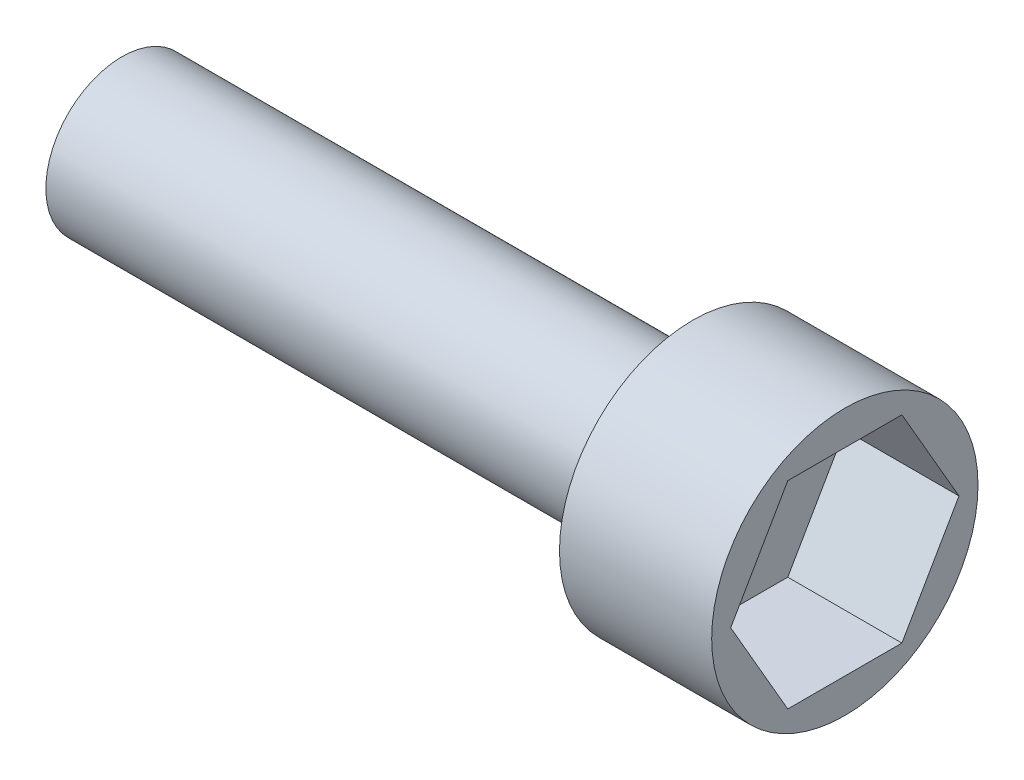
ISO-10303-21;
HEADER;
FILE_DESCRIPTION(('STEP AP214'),'2;1');
FILE_NAME('part.step','',(''),(''),'','','');
FILE_SCHEMA(('AUTOMOTIVE_DESIGN { 1 0 10303 214 1 1 1 1 }'));
ENDSEC;
DATA;
#1=APPLICATION_CONTEXT('core data for automotive mechanical design processes');
#2=APPLICATION_PROTOCOL_DEFINITION('international standard','automotive_design',2000,#1);
#3=PRODUCT_CONTEXT('',#1,'mechanical');
#4=PRODUCT('Part','Part','',(#3));
#5=PRODUCT_RELATED_PRODUCT_CATEGORY('part','',(#4));
#6=PRODUCT_DEFINITION_FORMATION('','',#4);
#7=PRODUCT_DEFINITION_CONTEXT('part definition',#1,'design');
#8=PRODUCT_DEFINITION('design','',#6,#7);
#9=PRODUCT_DEFINITION_SHAPE('','',#8);
#10=(LENGTH_UNIT() NAMED_UNIT(*) SI_UNIT(.MILLI.,.METRE.));
#11=(NAMED_UNIT(*) PLANE_ANGLE_UNIT() SI_UNIT($,.RADIAN.));
#12=(NAMED_UNIT(*) SI_UNIT($,.STERADIAN.) SOLID_ANGLE_UNIT());
#13=UNCERTAINTY_MEASURE_WITH_UNIT(LENGTH_MEASURE(1.E-05),#10,'distance_accuracy_value','');
#14=(GEOMETRIC_REPRESENTATION_CONTEXT(3) GLOBAL_UNCERTAINTY_ASSIGNED_CONTEXT((#13)) GLOBAL_UNIT_ASSIGNED_CONTEXT((#10,
#11,#12)) REPRESENTATION_CONTEXT('',''));
#15=CARTESIAN_POINT('',(0.,0.,0.));
#16=DIRECTION('',(0.,0.,1.));
#17=DIRECTION('',(1.,0.,0.));
#18=AXIS2_PLACEMENT_3D('',#15,#16,#17);
#19=CARTESIAN_POINT('',(15.,0.,0.));
#20=DIRECTION('',(-1.,0.,0.));
#21=DIRECTION('',(0.,0.,1.));
#22=AXIS2_PLACEMENT_3D('',#19,#20,#21);
#23=CYLINDRICAL_SURFACE('',#22,2.);
#24=CARTESIAN_POINT('',(15.,0.,0.));
#25=DIRECTION('',(1.,0.,0.));
#26=DIRECTION('',(0.,0.,-1.));
#27=AXIS2_PLACEMENT_3D('',#24,#25,#26);
#28=CIRCLE('',#27,2.);
#29=CARTESIAN_POINT('',(15.,0.,-2.));
#30=VERTEX_POINT('',#29);
#31=EDGE_CURVE('E11',#30,#30,#28,.T.);
#32=ORIENTED_EDGE('',*,*,#31,.F.);
#33=EDGE_LOOP('',(#32));
#34=FACE_BOUND('',#33,.T.);
#35=CARTESIAN_POINT('',(0.,0.,0.));
#36=DIRECTION('',(1.,0.,0.));
#37=DIRECTION('',(0.,0.,-1.));
#38=AXIS2_PLACEMENT_3D('',#35,#36,#37);
#39=CIRCLE('',#38,2.);
#40=CARTESIAN_POINT('',(0.,0.,-2.));
#41=VERTEX_POINT('',#40);
#42=EDGE_CURVE('E48',#41,#41,#39,.T.);
#43=ORIENTED_EDGE('',*,*,#42,.T.);
#44=EDGE_LOOP('',(#43));
#45=FACE_BOUND('',#44,.T.);
#46=ADVANCED_FACE('F45',(#34,#45),#23,.T.);
#47=CARTESIAN_POINT('',(0.,0.,0.));
#48=DIRECTION('',(1.,0.,0.));
#49=DIRECTION('',(0.,0.,-1.));
#50=AXIS2_PLACEMENT_3D('',#47,#48,#49);
#51=PLANE('',#50);
#52=ORIENTED_EDGE('',*,*,#42,.F.);
#53=EDGE_LOOP('',(#52));
#54=FACE_BOUND('',#53,.T.);
#55=ADVANCED_FACE('F196',(#54),#51,.F.);
#56=CARTESIAN_POINT('',(19.,0.,0.));
#57=DIRECTION('',(-1.,0.,0.));
#58=DIRECTION('',(0.,0.,1.));
#59=AXIS2_PLACEMENT_3D('',#56,#57,#58);
#60=CYLINDRICAL_SURFACE('',#59,3.5);
#61=CARTESIAN_POINT('',(19.,0.,0.));
#62=DIRECTION('',(1.,0.,0.));
#63=DIRECTION('',(0.,0.,-1.));
#64=AXIS2_PLACEMENT_3D('',#61,#62,#63);
#65=CIRCLE('',#64,3.5);
#66=CARTESIAN_POINT('',(19.,0.,-3.5));
#67=VERTEX_POINT('',#66);
#68=EDGE_CURVE('E169',#67,#67,#65,.T.);
#69=ORIENTED_EDGE('',*,*,#68,.F.);
#70=EDGE_LOOP('',(#69));
#71=FACE_BOUND('',#70,.T.);
#72=CARTESIAN_POINT('',(15.,0.,0.));
#73=DIRECTION('',(1.,0.,0.));
#74=DIRECTION('',(0.,0.,-1.));
#75=AXIS2_PLACEMENT_3D('',#72,#73,#74);
#76=CIRCLE('',#75,3.5);
#77=CARTESIAN_POINT('',(15.,0.,-3.5));
#78=VERTEX_POINT('',#77);
#79=EDGE_CURVE('E159',#78,#78,#76,.T.);
#80=ORIENTED_EDGE('',*,*,#79,.T.);
#81=EDGE_LOOP('',(#80));
#82=FACE_BOUND('',#81,.T.);
#83=ADVANCED_FACE('F177',(#71,#82),#60,.T.);
#84=CARTESIAN_POINT('',(19.,0.,0.));
#85=DIRECTION('',(1.,0.,0.));
#86=DIRECTION('',(0.,0.,-1.));
#87=AXIS2_PLACEMENT_3D('',#84,#85,#86);
#88=PLANE('',#87);
#89=DIRECTION('',(0.,-0.866025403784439,0.5));
#90=VECTOR('',#89,1.);
#91=CARTESIAN_POINT('',(19.,2.59807621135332,1.5));
#92=LINE('',#91,#90);
#93=CARTESIAN_POINT('',(19.,2.59807621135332,1.5));
#94=VERTEX_POINT('',#93);
#95=CARTESIAN_POINT('',(19.,0.,3.));
#96=VERTEX_POINT('',#95);
#97=EDGE_CURVE('E60',#94,#96,#92,.T.);
#98=ORIENTED_EDGE('',*,*,#97,.F.);
#99=DIRECTION('',(0.,0.,1.));
#100=VECTOR('',#99,1.);
#101=CARTESIAN_POINT('',(19.,2.59807621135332,-1.5));
#102=LINE('',#101,#100);
#103=CARTESIAN_POINT('',(19.,2.59807621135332,-1.5));
#104=VERTEX_POINT('',#103);
#105=EDGE_CURVE('E153',#104,#94,#102,.T.);
#106=ORIENTED_EDGE('',*,*,#105,.F.);
#107=DIRECTION('',(0.,0.866025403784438,0.5));
#108=VECTOR('',#107,1.);
#109=CARTESIAN_POINT('',(19.,0.,-3.));
#110=LINE('',#109,#108);
#111=CARTESIAN_POINT('',(19.,0.,-3.));
#112=VERTEX_POINT('',#111);
#113=EDGE_CURVE('E150',#112,#104,#110,.T.);
#114=ORIENTED_EDGE('',*,*,#113,.F.);
#115=DIRECTION('',(0.,0.866025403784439,-0.5));
#116=VECTOR('',#115,1.);
#117=CARTESIAN_POINT('',(19.,-2.59807621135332,-1.5));
#118=LINE('',#117,#116);
#119=CARTESIAN_POINT('',(19.,-2.59807621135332,-1.5));
#120=VERTEX_POINT('',#119);
#121=EDGE_CURVE('E108',#120,#112,#118,.T.);
#122=ORIENTED_EDGE('',*,*,#121,.F.);
#123=DIRECTION('',(0.,0.,-1.));
#124=VECTOR('',#123,1.);
#125=CARTESIAN_POINT('',(19.,-2.59807621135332,1.5));
#126=LINE('',#125,#124);
#127=CARTESIAN_POINT('',(19.,-2.59807621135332,1.5));
#128=VERTEX_POINT('',#127);
#129=EDGE_CURVE('E144',#128,#120,#126,.T.);
#130=ORIENTED_EDGE('',*,*,#129,.F.);
#131=DIRECTION('',(0.,-0.866025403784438,-0.5));
#132=VECTOR('',#131,1.);
#133=CARTESIAN_POINT('',(19.,0.,3.));
#134=LINE('',#133,#132);
#135=EDGE_CURVE('E140',#96,#128,#134,.T.);
#136=ORIENTED_EDGE('',*,*,#135,.F.);
#137=EDGE_LOOP('',(#98,#106,#114,#122,#130,#136));
#138=FACE_BOUND('',#137,.T.);
#139=ORIENTED_EDGE('',*,*,#68,.T.);
#140=EDGE_LOOP('',(#139));
#141=FACE_BOUND('',#140,.T.);
#142=ADVANCED_FACE('F182',(#138,#141),#88,.T.);
#143=CARTESIAN_POINT('',(15.,0.,0.));
#144=DIRECTION('',(1.,0.,0.));
#145=DIRECTION('',(0.,0.,-1.));
#146=AXIS2_PLACEMENT_3D('',#143,#144,#145);
#147=PLANE('',#146);
#148=ORIENTED_EDGE('',*,*,#31,.T.);
#149=EDGE_LOOP('',(#148));
#150=FACE_BOUND('',#149,.T.);
#151=ORIENTED_EDGE('',*,*,#79,.F.);
#152=EDGE_LOOP('',(#151));
#153=FACE_BOUND('',#152,.T.);
#154=ADVANCED_FACE('F179',(#150,#153),#147,.F.);
#155=CARTESIAN_POINT('',(16.,2.59807621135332,1.5));
#156=DIRECTION('',(0.,0.5,0.866025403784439));
#157=DIRECTION('',(0.,-0.866025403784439,0.5));
#158=AXIS2_PLACEMENT_3D('',#155,#156,#157);
#159=PLANE('',#158);
#160=ORIENTED_EDGE('',*,*,#97,.T.);
#161=DIRECTION('',(1.,0.,0.));
#162=VECTOR('',#161,1.);
#163=CARTESIAN_POINT('',(16.,0.,3.));
#164=LINE('',#163,#162);
#165=CARTESIAN_POINT('',(16.,0.,3.));
#166=VERTEX_POINT('',#165);
#167=EDGE_CURVE('E90',#166,#96,#164,.T.);
#168=ORIENTED_EDGE('',*,*,#167,.F.);
#169=DIRECTION('',(0.,-0.866025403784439,0.5));
#170=VECTOR('',#169,1.);
#171=CARTESIAN_POINT('',(16.,2.59807621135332,1.5));
#172=LINE('',#171,#170);
#173=CARTESIAN_POINT('',(16.,2.59807621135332,1.5));
#174=VERTEX_POINT('',#173);
#175=EDGE_CURVE('E156',#174,#166,#172,.T.);
#176=ORIENTED_EDGE('',*,*,#175,.F.);
#177=DIRECTION('',(1.,0.,0.));
#178=VECTOR('',#177,1.);
#179=CARTESIAN_POINT('',(16.,2.59807621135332,1.5));
#180=LINE('',#179,#178);
#181=EDGE_CURVE('E68',#174,#94,#180,.T.);
#182=ORIENTED_EDGE('',*,*,#181,.T.);
#183=EDGE_LOOP('',(#160,#168,#176,#182));
#184=FACE_BOUND('',#183,.T.);
#185=ADVANCED_FACE('F181',(#184),#159,.F.);
#186=CARTESIAN_POINT('',(16.,2.59807621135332,-1.5));
#187=DIRECTION('',(0.,1.,0.));
#188=DIRECTION('',(0.,0.,1.));
#189=AXIS2_PLACEMENT_3D('',#186,#187,#188);
#190=PLANE('',#189);
#191=ORIENTED_EDGE('',*,*,#105,.T.);
#192=ORIENTED_EDGE('',*,*,#181,.F.);
#193=DIRECTION('',(0.,0.,1.));
#194=VECTOR('',#193,1.);
#195=CARTESIAN_POINT('',(16.,2.59807621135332,-1.5));
#196=LINE('',#195,#194);
#197=CARTESIAN_POINT('',(16.,2.59807621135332,-1.5));
#198=VERTEX_POINT('',#197);
#199=EDGE_CURVE('E122',#198,#174,#196,.T.);
#200=ORIENTED_EDGE('',*,*,#199,.F.);
#201=DIRECTION('',(1.,0.,0.));
#202=VECTOR('',#201,1.);
#203=CARTESIAN_POINT('',(16.,2.59807621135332,-1.5));
#204=LINE('',#203,#202);
#205=EDGE_CURVE('E113',#198,#104,#204,.T.);
#206=ORIENTED_EDGE('',*,*,#205,.T.);
#207=EDGE_LOOP('',(#191,#192,#200,#206));
#208=FACE_BOUND('',#207,.T.);
#209=ADVANCED_FACE('F190',(#208),#190,.F.);
#210=CARTESIAN_POINT('',(16.,0.,-3.));
#211=DIRECTION('',(0.,0.5,-0.866025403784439));
#212=DIRECTION('',(0.,0.866025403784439,0.5));
#213=AXIS2_PLACEMENT_3D('',#210,#211,#212);
#214=PLANE('',#213);
#215=ORIENTED_EDGE('',*,*,#113,.T.);
#216=ORIENTED_EDGE('',*,*,#205,.F.);
#217=DIRECTION('',(0.,0.866025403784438,0.5));
#218=VECTOR('',#217,1.);
#219=CARTESIAN_POINT('',(16.,0.,-3.));
#220=LINE('',#219,#218);
#221=CARTESIAN_POINT('',(16.,0.,-3.));
#222=VERTEX_POINT('',#221);
#223=EDGE_CURVE('E117',#222,#198,#220,.T.);
#224=ORIENTED_EDGE('',*,*,#223,.F.);
#225=DIRECTION('',(1.,0.,0.));
#226=VECTOR('',#225,1.);
#227=CARTESIAN_POINT('',(16.,0.,-3.));
#228=LINE('',#227,#226);
#229=EDGE_CURVE('E101',#222,#112,#228,.T.);
#230=ORIENTED_EDGE('',*,*,#229,.T.);
#231=EDGE_LOOP('',(#215,#216,#224,#230));
#232=FACE_BOUND('',#231,.T.);
#233=ADVANCED_FACE('F118',(#232),#214,.F.);
#234=CARTESIAN_POINT('',(16.,-2.59807621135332,-1.5));
#235=DIRECTION('',(0.,-0.5,-0.866025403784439));
#236=DIRECTION('',(0.,0.866025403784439,-0.5));
#237=AXIS2_PLACEMENT_3D('',#234,#235,#236);
#238=PLANE('',#237);
#239=ORIENTED_EDGE('',*,*,#121,.T.);
#240=ORIENTED_EDGE('',*,*,#229,.F.);
#241=DIRECTION('',(0.,0.866025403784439,-0.5));
#242=VECTOR('',#241,1.);
#243=CARTESIAN_POINT('',(16.,-2.59807621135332,-1.5));
#244=LINE('',#243,#242);
#245=CARTESIAN_POINT('',(16.,-2.59807621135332,-1.5));
#246=VERTEX_POINT('',#245);
#247=EDGE_CURVE('E105',#246,#222,#244,.T.);
#248=ORIENTED_EDGE('',*,*,#247,.F.);
#249=DIRECTION('',(1.,0.,0.));
#250=VECTOR('',#249,1.);
#251=CARTESIAN_POINT('',(16.,-2.59807621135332,-1.5));
#252=LINE('',#251,#250);
#253=EDGE_CURVE('E114',#246,#120,#252,.T.);
#254=ORIENTED_EDGE('',*,*,#253,.T.);
#255=EDGE_LOOP('',(#239,#240,#248,#254));
#256=FACE_BOUND('',#255,.T.);
#257=ADVANCED_FACE('F103',(#256),#238,.F.);
#258=CARTESIAN_POINT('',(16.,-2.59807621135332,1.5));
#259=DIRECTION('',(0.,-1.,0.));
#260=DIRECTION('',(0.,0.,-1.));
#261=AXIS2_PLACEMENT_3D('',#258,#259,#260);
#262=PLANE('',#261);
#263=ORIENTED_EDGE('',*,*,#129,.T.);
#264=ORIENTED_EDGE('',*,*,#253,.F.);
#265=DIRECTION('',(0.,0.,-1.));
#266=VECTOR('',#265,1.);
#267=CARTESIAN_POINT('',(16.,-2.59807621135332,1.5));
#268=LINE('',#267,#266);
#269=CARTESIAN_POINT('',(16.,-2.59807621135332,1.5));
#270=VERTEX_POINT('',#269);
#271=EDGE_CURVE('E128',#270,#246,#268,.T.);
#272=ORIENTED_EDGE('',*,*,#271,.F.);
#273=DIRECTION('',(1.,0.,0.));
#274=VECTOR('',#273,1.);
#275=CARTESIAN_POINT('',(16.,-2.59807621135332,1.5));
#276=LINE('',#275,#274);
#277=EDGE_CURVE('E164',#270,#128,#276,.T.);
#278=ORIENTED_EDGE('',*,*,#277,.T.);
#279=EDGE_LOOP('',(#263,#264,#272,#278));
#280=FACE_BOUND('',#279,.T.);
#281=ADVANCED_FACE('F259',(#280),#262,.F.);
#282=CARTESIAN_POINT('',(16.,0.,3.));
#283=DIRECTION('',(0.,-0.5,0.866025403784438));
#284=DIRECTION('',(0.,-0.866025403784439,-0.5));
#285=AXIS2_PLACEMENT_3D('',#282,#283,#284);
#286=PLANE('',#285);
#287=ORIENTED_EDGE('',*,*,#135,.T.);
#288=ORIENTED_EDGE('',*,*,#277,.F.);
#289=DIRECTION('',(0.,-0.866025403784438,-0.5));
#290=VECTOR('',#289,1.);
#291=CARTESIAN_POINT('',(16.,0.,3.));
#292=LINE('',#291,#290);
#293=EDGE_CURVE('E132',#166,#270,#292,.T.);
#294=ORIENTED_EDGE('',*,*,#293,.F.);
#295=ORIENTED_EDGE('',*,*,#167,.T.);
#296=EDGE_LOOP('',(#287,#288,#294,#295));
#297=FACE_BOUND('',#296,.T.);
#298=ADVANCED_FACE('F268',(#297),#286,.F.);
#299=CARTESIAN_POINT('',(16.,0.,0.));
#300=DIRECTION('',(1.,0.,0.));
#301=DIRECTION('',(0.,0.,-1.));
#302=AXIS2_PLACEMENT_3D('',#299,#300,#301);
#303=PLANE('',#302);
#304=ORIENTED_EDGE('',*,*,#175,.T.);
#305=ORIENTED_EDGE('',*,*,#293,.T.);
#306=ORIENTED_EDGE('',*,*,#271,.T.);
#307=ORIENTED_EDGE('',*,*,#247,.T.);
#308=ORIENTED_EDGE('',*,*,#223,.T.);
#309=ORIENTED_EDGE('',*,*,#199,.T.);
#310=EDGE_LOOP('',(#304,#305,#306,#307,#308,#309));
#311=FACE_BOUND('',#310,.T.);
#312=ADVANCED_FACE('F125',(#311),#303,.T.);
#313=CLOSED_SHELL('',(#46,#55,#83,#142,#154,#185,#209,#233,#257,#281,#298,#312));
#314=MANIFOLD_SOLID_BREP('B2',#313);
#315=ADVANCED_BREP_SHAPE_REPRESENTATION('',(#18,#314),#14);
#316=SHAPE_DEFINITION_REPRESENTATION(#9,#315);
ENDSEC;
END-ISO-10303-21;
